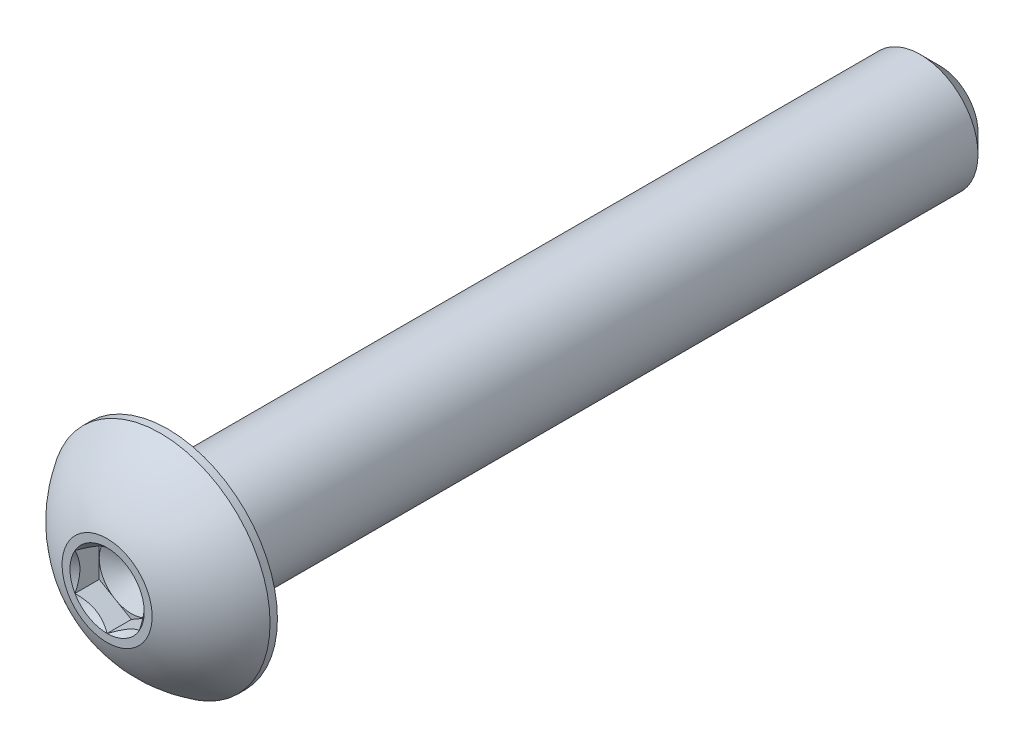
from build123d import *

# Parameters (mm, degrees)
CUT_EXTRUDE1_START = 9.67486
CUT_EXTRUDE1_DEPTH = 2.288550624


with BuildPart() as part:
    # Sketch2 → Revolve1 (revolve)
    with BuildSketch(Plane(origin=(0, 0, 0), x_dir=(0, 0, -1), z_dir=(1, 0, 0)), mode=Mode.PRIVATE) as revolve1_sk:
        with BuildLine():
            Line((-10.2743, 0.79375), (-10.2743, 1.11125))
            ThreePointArc((-10.2743, 1.11125), (-9.74937089, 2.018629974), (-8.957128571, 2.7051))
            Line((-8.957128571, 2.7051), (-8.7757, 2.7051))
            Line((-8.7757, 2.7051), (-8.7757, 1.4224))
            Line((-8.7757, 1.4224), (9.79805, 1.4224))
            Line((9.79805, 1.4224), (10.2743, 0.94615))
            Line((10.2743, 0.94615), (10.2743, 0))
            Line((10.2743, 0), (-9.216588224, 0))
            Line((-9.216588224, 0), (-9.67486, 0.79375))
            Line((-9.67486, 0.79375), (-10.2743, 0.79375))
        make_face()
    revolve(revolve1_sk.sketch.rotate(Axis((0, 0, 10.2743), (0, 0, -1)), 90), axis=Axis((0, 0, 10.2743), (0, 0, -1)))

    # Sketch3 → Cut-Extrude1 (cut, through all)
    with BuildSketch(Plane.XY.offset(CUT_EXTRUDE1_START)):
        Polygon((0, 0.916543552), (-0.79375, 0.458271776), (-0.79375, -0.458271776), (0, -0.916543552), (0.79375, -0.458271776), (0.79375, 0.458271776), align=None)
    extrude(amount=CUT_EXTRUDE1_DEPTH, mode=Mode.SUBTRACT)

    # Cut-Extrude2 cone 1 section (on through the dimple's axis) → Cut-Extrude2 (revolve, cut)
    with BuildSketch(Plane(origin=(0, 0, 10.2743), x_dir=(0, -1, 0), z_dir=(1, 0, 0))):
        Polygon((0, 0), (0.916543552, 0), (0, 0.916543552), align=None)
    revolve(axis=Axis((0, 0, 10.2743), (0, 0, -1)), mode=Mode.SUBTRACT)


solid = part.part
